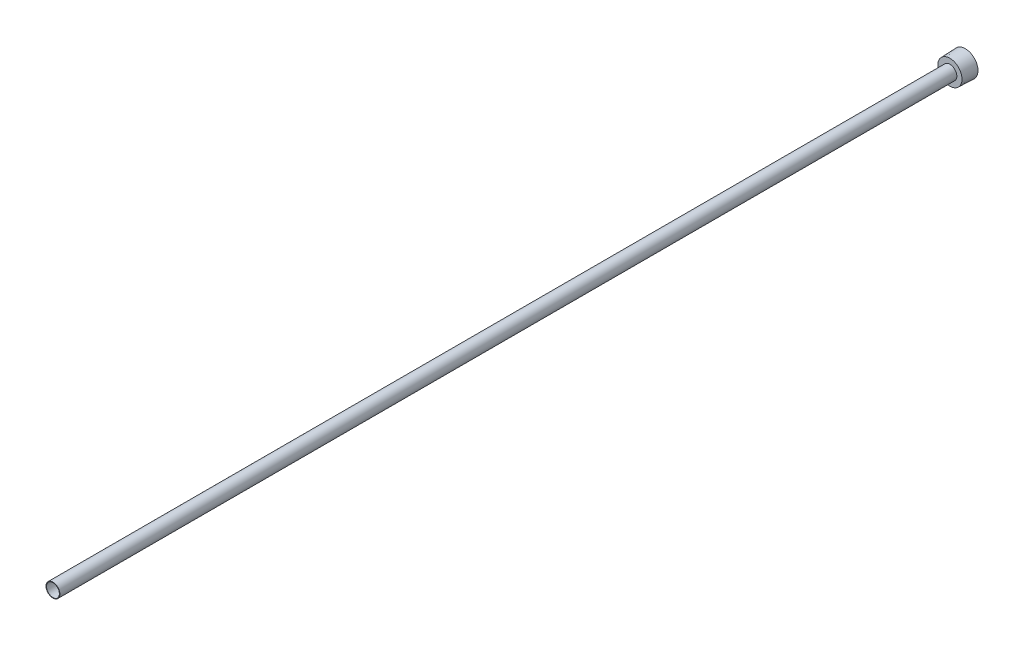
from build123d import *

# Parameters (mm, degrees)
SKETCH2_R          = 4.318
CUT_EXTRUDE1_DEPTH = 610.717698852
CUT_EXTRUDE2_DEPTH = 6.35


with BuildPart() as part:
    # Sketch1 → Revolve1 (revolve)
    with BuildSketch(Plane(origin=(0, 0, 0), x_dir=(0, 0, -1), z_dir=(1, 0, 0)), mode=Mode.PRIVATE) as revolve1_sk:
        Polygon((0, 0), (0, 8.4709), (-10.3124, 8.094743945), (-10.3124, 4.6355), (-609.6, 4.6355), (-609.6, 0), align=None)
    revolve(revolve1_sk.sketch.rotate(Axis((0, 0, 168.793426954), (0, 0, -1)), 90), axis=Axis((0, 0, 168.793426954), (0, 0, -1)))

    # Sketch2 → Cut-Extrude1 (cut, through all)
    with BuildSketch(Plane.XY.offset(609.6)):
        Circle(SKETCH2_R)
    extrude(amount=-CUT_EXTRUDE1_DEPTH, mode=Mode.SUBTRACT)

    # Sketch3 → Cut-Extrude2 (cut)
    with BuildSketch(Plane(origin=(0, 0, 0), x_dir=(-1, 0, 0), z_dir=(0, 0, -1))):
        Polygon((-4.7625, -2.749630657), (0, -5.499261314), (4.7625, -2.749630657), (4.7625, 2.749630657), (0, 5.499261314), (-4.7625, 2.749630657), align=None)
    extrude(amount=-CUT_EXTRUDE2_DEPTH, mode=Mode.SUBTRACT)


solid = part.part
